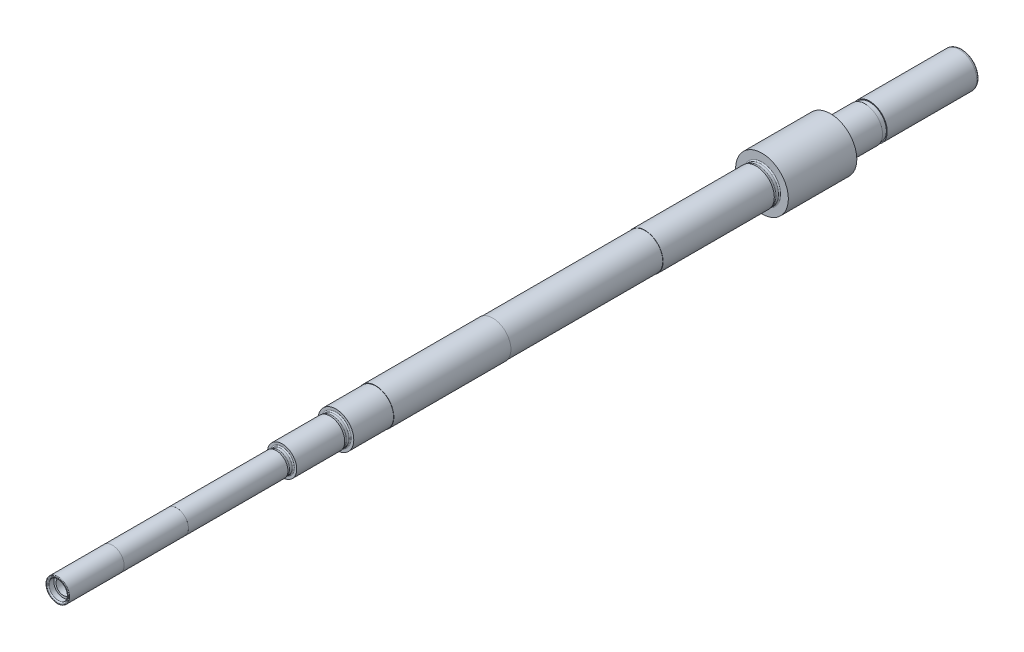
ISO-10303-21;
HEADER;
FILE_DESCRIPTION(('STEP AP214'),'2;1');
FILE_NAME('part.step','',(''),(''),'','','');
FILE_SCHEMA(('AUTOMOTIVE_DESIGN { 1 0 10303 214 1 1 1 1 }'));
ENDSEC;
DATA;
#1=APPLICATION_CONTEXT('core data for automotive mechanical design processes');
#2=APPLICATION_PROTOCOL_DEFINITION('international standard','automotive_design',2000,#1);
#3=PRODUCT_CONTEXT('',#1,'mechanical');
#4=PRODUCT('Part','Part','',(#3));
#5=PRODUCT_RELATED_PRODUCT_CATEGORY('part','',(#4));
#6=PRODUCT_DEFINITION_FORMATION('','',#4);
#7=PRODUCT_DEFINITION_CONTEXT('part definition',#1,'design');
#8=PRODUCT_DEFINITION('design','',#6,#7);
#9=PRODUCT_DEFINITION_SHAPE('','',#8);
#10=(LENGTH_UNIT() NAMED_UNIT(*) SI_UNIT(.MILLI.,.METRE.));
#11=(NAMED_UNIT(*) PLANE_ANGLE_UNIT() SI_UNIT($,.RADIAN.));
#12=(NAMED_UNIT(*) SI_UNIT($,.STERADIAN.) SOLID_ANGLE_UNIT());
#13=UNCERTAINTY_MEASURE_WITH_UNIT(LENGTH_MEASURE(1.E-05),#10,'distance_accuracy_value','');
#14=(GEOMETRIC_REPRESENTATION_CONTEXT(3) GLOBAL_UNCERTAINTY_ASSIGNED_CONTEXT((#13)) GLOBAL_UNIT_ASSIGNED_CONTEXT((#10,
#11,#12)) REPRESENTATION_CONTEXT('',''));
#15=CARTESIAN_POINT('',(0.,0.,0.));
#16=DIRECTION('',(0.,0.,1.));
#17=DIRECTION('',(1.,0.,0.));
#18=AXIS2_PLACEMENT_3D('',#15,#16,#17);
#19=CARTESIAN_POINT('',(0.,0.,146.599999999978));
#20=DIRECTION('',(0.,0.,1.));
#21=DIRECTION('',(1.,0.,0.));
#22=AXIS2_PLACEMENT_3D('',#19,#20,#21);
#23=CONICAL_SURFACE('',#22,1.22934999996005,1.22173047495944);
#24=CARTESIAN_POINT('',(5.6843418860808E-11,0.,146.152553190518));
#25=VERTEX_POINT('',#24);
#26=VERTEX_LOOP('',#25);
#27=FACE_BOUND('',#26,.T.);
#28=CARTESIAN_POINT('',(0.,0.,146.6));
#29=DIRECTION('',(0.,0.,-1.));
#30=DIRECTION('',(-1.,0.,0.));
#31=AXIS2_PLACEMENT_3D('',#28,#29,#30);
#32=CIRCLE('',#31,1.22935);
#33=CARTESIAN_POINT('',(-1.22935,0.,146.6));
#34=VERTEX_POINT('',#33);
#35=EDGE_CURVE('E72',#34,#34,#32,.F.);
#36=ORIENTED_EDGE('',*,*,#35,.T.);
#37=EDGE_LOOP('',(#36));
#38=FACE_BOUND('',#37,.T.);
#39=ADVANCED_FACE('F17',(#27,#38),#23,.F.);
#40=CARTESIAN_POINT('',(0.,0.,154.6));
#41=DIRECTION('',(0.,0.,-1.));
#42=DIRECTION('',(-1.,0.,0.));
#43=AXIS2_PLACEMENT_3D('',#40,#41,#42);
#44=CYLINDRICAL_SURFACE('',#43,1.22935);
#45=ORIENTED_EDGE('',*,*,#35,.F.);
#46=EDGE_LOOP('',(#45));
#47=FACE_BOUND('',#46,.T.);
#48=CARTESIAN_POINT('',(0.,0.,153.6));
#49=DIRECTION('',(0.,0.,-1.));
#50=DIRECTION('',(-1.,0.,0.));
#51=AXIS2_PLACEMENT_3D('',#48,#49,#50);
#52=CIRCLE('',#51,1.22935);
#53=CARTESIAN_POINT('',(-1.22935,0.,153.6));
#54=VERTEX_POINT('',#53);
#55=EDGE_CURVE('E20',#54,#54,#52,.F.);
#56=ORIENTED_EDGE('',*,*,#55,.T.);
#57=EDGE_LOOP('',(#56));
#58=FACE_BOUND('',#57,.T.);
#59=ADVANCED_FACE('F69',(#47,#58),#44,.F.);
#60=CARTESIAN_POINT('',(0.,0.,153.6));
#61=DIRECTION('',(0.,0.,-1.));
#62=DIRECTION('',(-1.,0.,0.));
#63=AXIS2_PLACEMENT_3D('',#60,#61,#62);
#64=PLANE('',#63);
#65=ORIENTED_EDGE('',*,*,#55,.F.);
#66=EDGE_LOOP('',(#65));
#67=FACE_BOUND('',#66,.T.);
#68=CARTESIAN_POINT('',(0.,0.,153.6));
#69=DIRECTION('',(0.,0.,-1.));
#70=DIRECTION('',(-1.,0.,0.));
#71=AXIS2_PLACEMENT_3D('',#68,#69,#70);
#72=CIRCLE('',#71,1.6);
#73=CARTESIAN_POINT('',(-1.6,0.,153.6));
#74=VERTEX_POINT('',#73);
#75=EDGE_CURVE('E76',#74,#74,#72,.F.);
#76=ORIENTED_EDGE('',*,*,#75,.T.);
#77=EDGE_LOOP('',(#76));
#78=FACE_BOUND('',#77,.T.);
#79=ADVANCED_FACE('F576',(#67,#78),#64,.F.);
#80=CARTESIAN_POINT('',(0.,0.,154.6));
#81=DIRECTION('',(0.,0.,-1.));
#82=DIRECTION('',(-1.,0.,0.));
#83=AXIS2_PLACEMENT_3D('',#80,#81,#82);
#84=CYLINDRICAL_SURFACE('',#83,1.6);
#85=ORIENTED_EDGE('',*,*,#75,.F.);
#86=EDGE_LOOP('',(#85));
#87=FACE_BOUND('',#86,.T.);
#88=CARTESIAN_POINT('',(0.,0.,154.4));
#89=DIRECTION('',(0.,0.,1.));
#90=DIRECTION('',(-1.,0.,0.));
#91=AXIS2_PLACEMENT_3D('',#88,#89,#90);
#92=CIRCLE('',#91,1.6);
#93=CARTESIAN_POINT('',(-1.6,0.,154.4));
#94=VERTEX_POINT('',#93);
#95=EDGE_CURVE('E566',#94,#94,#92,.F.);
#96=ORIENTED_EDGE('',*,*,#95,.F.);
#97=EDGE_LOOP('',(#96));
#98=FACE_BOUND('',#97,.T.);
#99=ADVANCED_FACE('F572',(#87,#98),#84,.F.);
#100=CARTESIAN_POINT('',(0.,0.,154.4));
#101=DIRECTION('',(0.,0.,1.));
#102=DIRECTION('',(-1.,0.,0.));
#103=AXIS2_PLACEMENT_3D('',#100,#101,#102);
#104=TOROIDAL_SURFACE('',#103,1.8,0.2);
#105=CARTESIAN_POINT('',(0.,0.,154.6));
#106=DIRECTION('',(0.,0.,1.));
#107=DIRECTION('',(1.,0.,0.));
#108=AXIS2_PLACEMENT_3D('',#105,#106,#107);
#109=CIRCLE('',#108,1.8);
#110=CARTESIAN_POINT('',(1.8,0.,154.6));
#111=VERTEX_POINT('',#110);
#112=EDGE_CURVE('E523',#111,#111,#109,.F.);
#113=ORIENTED_EDGE('',*,*,#112,.F.);
#114=EDGE_LOOP('',(#113));
#115=FACE_BOUND('',#114,.T.);
#116=ORIENTED_EDGE('',*,*,#95,.T.);
#117=EDGE_LOOP('',(#116));
#118=FACE_BOUND('',#117,.T.);
#119=ADVANCED_FACE('F568',(#115,#118),#104,.T.);
#120=CARTESIAN_POINT('',(0.,0.,2.71509783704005));
#121=DIRECTION('',(0.,0.,-1.));
#122=DIRECTION('',(-1.,0.,0.));
#123=AXIS2_PLACEMENT_3D('',#120,#121,#122);
#124=CONICAL_SURFACE('',#123,0.624999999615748,1.04719755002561);
#125=CARTESIAN_POINT('',(0.,0.,3.07594175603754));
#126=VERTEX_POINT('',#125);
#127=VERTEX_LOOP('',#126);
#128=FACE_BOUND('',#127,.T.);
#129=CARTESIAN_POINT('',(0.,0.,2.71509783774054));
#130=DIRECTION('',(0.,0.,-1.));
#131=DIRECTION('',(-1.,0.,0.));
#132=AXIS2_PLACEMENT_3D('',#129,#130,#131);
#133=CIRCLE('',#132,0.625);
#134=CARTESIAN_POINT('',(-0.625000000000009,0.,2.71509783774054));
#135=VERTEX_POINT('',#134);
#136=EDGE_CURVE('E519',#135,#135,#133,.T.);
#137=ORIENTED_EDGE('',*,*,#136,.T.);
#138=EDGE_LOOP('',(#137));
#139=FACE_BOUND('',#138,.T.);
#140=ADVANCED_FACE('F544',(#128,#139),#124,.F.);
#141=CARTESIAN_POINT('',(0.,0.,154.6));
#142=DIRECTION('',(0.,0.,1.));
#143=DIRECTION('',(1.,0.,0.));
#144=AXIS2_PLACEMENT_3D('',#141,#142,#143);
#145=PLANE('',#144);
#146=CARTESIAN_POINT('',(0.,0.,154.6));
#147=DIRECTION('',(0.,0.,-1.));
#148=DIRECTION('',(1.,0.,0.));
#149=AXIS2_PLACEMENT_3D('',#146,#147,#148);
#150=CIRCLE('',#149,1.9);
#151=CARTESIAN_POINT('',(1.9,0.,154.6));
#152=VERTEX_POINT('',#151);
#153=EDGE_CURVE('E522',#152,#152,#150,.T.);
#154=ORIENTED_EDGE('',*,*,#153,.F.);
#155=EDGE_LOOP('',(#154));
#156=FACE_BOUND('',#155,.T.);
#157=ORIENTED_EDGE('',*,*,#112,.T.);
#158=EDGE_LOOP('',(#157));
#159=FACE_BOUND('',#158,.T.);
#160=ADVANCED_FACE('F535',(#156,#159),#145,.T.);
#161=CARTESIAN_POINT('',(0.,0.,-0.274058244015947));
#162=DIRECTION('',(0.,0.,-1.));
#163=DIRECTION('',(-1.,0.,0.));
#164=AXIS2_PLACEMENT_3D('',#161,#162,#163);
#165=CYLINDRICAL_SURFACE('',#164,0.625);
#166=ORIENTED_EDGE('',*,*,#136,.F.);
#167=EDGE_LOOP('',(#166));
#168=FACE_BOUND('',#167,.T.);
#169=CARTESIAN_POINT('',(0.,0.,2.23967007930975));
#170=DIRECTION('',(0.,0.,-1.));
#171=DIRECTION('',(1.,0.,0.));
#172=AXIS2_PLACEMENT_3D('',#169,#170,#171);
#173=CIRCLE('',#172,0.625);
#174=CARTESIAN_POINT('',(0.62499999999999,0.,2.23967007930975));
#175=VERTEX_POINT('',#174);
#176=EDGE_CURVE('E493',#175,#175,#173,.F.);
#177=ORIENTED_EDGE('',*,*,#176,.F.);
#178=EDGE_LOOP('',(#177));
#179=FACE_BOUND('',#178,.T.);
#180=ADVANCED_FACE('F512',(#168,#179),#165,.F.);
#181=CARTESIAN_POINT('',(0.,0.,154.5));
#182=DIRECTION('',(0.,0.,1.));
#183=DIRECTION('',(-1.,0.,0.));
#184=AXIS2_PLACEMENT_3D('',#181,#182,#183);
#185=TOROIDAL_SURFACE('',#184,1.9,0.1);
#186=ORIENTED_EDGE('',*,*,#153,.T.);
#187=EDGE_LOOP('',(#186));
#188=FACE_BOUND('',#187,.T.);
#189=CARTESIAN_POINT('',(0.,0.,154.5));
#190=DIRECTION('',(0.,0.,1.));
#191=DIRECTION('',(1.,0.,0.));
#192=AXIS2_PLACEMENT_3D('',#189,#190,#191);
#193=CIRCLE('',#192,2.);
#194=CARTESIAN_POINT('',(2.,0.,154.5));
#195=VERTEX_POINT('',#194);
#196=EDGE_CURVE('E484',#195,#195,#193,.F.);
#197=ORIENTED_EDGE('',*,*,#196,.F.);
#198=EDGE_LOOP('',(#197));
#199=FACE_BOUND('',#198,.T.);
#200=ADVANCED_FACE('F505',(#188,#199),#185,.T.);
#201=CARTESIAN_POINT('',(0.,0.,2.23967007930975));
#202=DIRECTION('',(0.,0.,-1.));
#203=DIRECTION('',(1.,0.,0.));
#204=AXIS2_PLACEMENT_3D('',#201,#202,#203);
#205=TOROIDAL_SURFACE('',#204,4.42570004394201,3.80070004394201);
#206=ORIENTED_EDGE('',*,*,#176,.T.);
#207=EDGE_LOOP('',(#206));
#208=FACE_BOUND('',#207,.T.);
#209=CARTESIAN_POINT('',(0.,0.,0.));
#210=DIRECTION('',(0.,0.,-1.));
#211=DIRECTION('',(-1.,0.,0.));
#212=AXIS2_PLACEMENT_3D('',#209,#210,#211);
#213=CIRCLE('',#212,1.355);
#214=CARTESIAN_POINT('',(-1.35500000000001,0.,0.));
#215=VERTEX_POINT('',#214);
#216=EDGE_CURVE('E492',#215,#215,#213,.F.);
#217=ORIENTED_EDGE('',*,*,#216,.F.);
#218=EDGE_LOOP('',(#217));
#219=FACE_BOUND('',#218,.T.);
#220=ADVANCED_FACE('F500',(#208,#219),#205,.T.);
#221=CARTESIAN_POINT('',(0.,0.,116.2));
#222=DIRECTION('',(0.,0.,1.));
#223=DIRECTION('',(1.,0.,0.));
#224=AXIS2_PLACEMENT_3D('',#221,#222,#223);
#225=CYLINDRICAL_SURFACE('',#224,2.);
#226=CARTESIAN_POINT('',(0.,0.,145.2));
#227=DIRECTION('',(0.,0.,1.));
#228=DIRECTION('',(1.,0.,0.));
#229=AXIS2_PLACEMENT_3D('',#226,#227,#228);
#230=CIRCLE('',#229,2.);
#231=CARTESIAN_POINT('',(2.,0.,145.2));
#232=VERTEX_POINT('',#231);
#233=EDGE_CURVE('E592',#232,#232,#230,.T.);
#234=ORIENTED_EDGE('',*,*,#233,.T.);
#235=EDGE_LOOP('',(#234));
#236=FACE_BOUND('',#235,.T.);
#237=ORIENTED_EDGE('',*,*,#196,.T.);
#238=EDGE_LOOP('',(#237));
#239=FACE_BOUND('',#238,.T.);
#240=ADVANCED_FACE('F504',(#236,#239),#225,.T.);
#241=CARTESIAN_POINT('',(0.,0.,0.));
#242=DIRECTION('',(0.,0.,-1.));
#243=DIRECTION('',(-1.,0.,0.));
#244=AXIS2_PLACEMENT_3D('',#241,#242,#243);
#245=PLANE('',#244);
#246=ORIENTED_EDGE('',*,*,#216,.T.);
#247=EDGE_LOOP('',(#246));
#248=FACE_BOUND('',#247,.T.);
#249=CARTESIAN_POINT('',(0.,0.,0.));
#250=DIRECTION('',(0.,0.,1.));
#251=DIRECTION('',(-1.,0.,0.));
#252=AXIS2_PLACEMENT_3D('',#249,#250,#251);
#253=CIRCLE('',#252,2.5);
#254=CARTESIAN_POINT('',(-2.5,0.,0.));
#255=VERTEX_POINT('',#254);
#256=EDGE_CURVE('E595',#255,#255,#253,.T.);
#257=ORIENTED_EDGE('',*,*,#256,.F.);
#258=EDGE_LOOP('',(#257));
#259=FACE_BOUND('',#258,.T.);
#260=ADVANCED_FACE('F645',(#248,#259),#245,.T.);
#261=CARTESIAN_POINT('',(0.,-1.8,11.));
#262=DIRECTION('',(0.,1.,0.));
#263=DIRECTION('',(0.,0.,1.));
#264=AXIS2_PLACEMENT_3D('',#261,#262,#263);
#265=PLANE('',#264);
#266=CARTESIAN_POINT('',(0.,-1.8,3.));
#267=DIRECTION('',(0.,1.,0.));
#268=DIRECTION('',(0.,0.,1.));
#269=AXIS2_PLACEMENT_3D('',#266,#267,#268);
#270=CIRCLE('',#269,1.00000000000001);
#271=CARTESIAN_POINT('',(-1.00000000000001,-1.8,3.));
#272=VERTEX_POINT('',#271);
#273=CARTESIAN_POINT('',(1.00000000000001,-1.8,3.));
#274=VERTEX_POINT('',#273);
#275=EDGE_CURVE('E457',#272,#274,#270,.F.);
#276=ORIENTED_EDGE('',*,*,#275,.T.);
#277=DIRECTION('',(0.,0.,-1.));
#278=VECTOR('',#277,1.);
#279=CARTESIAN_POINT('',(0.999999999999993,-1.8,11.));
#280=LINE('',#279,#278);
#281=CARTESIAN_POINT('',(0.999999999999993,-1.8,11.));
#282=VERTEX_POINT('',#281);
#283=EDGE_CURVE('E58',#274,#282,#280,.F.);
#284=ORIENTED_EDGE('',*,*,#283,.T.);
#285=CARTESIAN_POINT('',(0.,-1.8,11.));
#286=DIRECTION('',(0.,1.,0.));
#287=DIRECTION('',(0.,0.,1.));
#288=AXIS2_PLACEMENT_3D('',#285,#286,#287);
#289=CIRCLE('',#288,0.999999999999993);
#290=CARTESIAN_POINT('',(-1.,-1.8,11.));
#291=VERTEX_POINT('',#290);
#292=EDGE_CURVE('E61',#282,#291,#289,.F.);
#293=ORIENTED_EDGE('',*,*,#292,.T.);
#294=DIRECTION('',(0.,0.,1.));
#295=VECTOR('',#294,1.);
#296=CARTESIAN_POINT('',(-1.00000000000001,-1.8,3.));
#297=LINE('',#296,#295);
#298=EDGE_CURVE('E597',#291,#272,#297,.F.);
#299=ORIENTED_EDGE('',*,*,#298,.T.);
#300=EDGE_LOOP('',(#276,#284,#293,#299));
#301=FACE_BOUND('',#300,.T.);
#302=ADVANCED_FACE('F599',(#301),#265,.F.);
#303=CARTESIAN_POINT('',(0.,0.,145.2));
#304=DIRECTION('',(0.,0.,1.));
#305=DIRECTION('',(1.,0.,0.));
#306=AXIS2_PLACEMENT_3D('',#303,#304,#305);
#307=PLANE('',#306);
#308=CARTESIAN_POINT('',(0.,0.,145.2));
#309=DIRECTION('',(0.,0.,1.));
#310=DIRECTION('',(1.,0.,0.));
#311=AXIS2_PLACEMENT_3D('',#308,#309,#310);
#312=CIRCLE('',#311,1.995);
#313=CARTESIAN_POINT('',(1.995,0.,145.2));
#314=VERTEX_POINT('',#313);
#315=EDGE_CURVE('E445',#314,#314,#312,.F.);
#316=ORIENTED_EDGE('',*,*,#315,.F.);
#317=EDGE_LOOP('',(#316));
#318=FACE_BOUND('',#317,.T.);
#319=ORIENTED_EDGE('',*,*,#233,.F.);
#320=EDGE_LOOP('',(#319));
#321=FACE_BOUND('',#320,.T.);
#322=ADVANCED_FACE('F475',(#318,#321),#307,.F.);
#323=CARTESIAN_POINT('',(0.,0.,0.5));
#324=DIRECTION('',(0.,0.,-1.));
#325=DIRECTION('',(1.,0.,0.));
#326=AXIS2_PLACEMENT_3D('',#323,#324,#325);
#327=TOROIDAL_SURFACE('',#326,2.5,0.5);
#328=CARTESIAN_POINT('',(0.,0.,0.499999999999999));
#329=DIRECTION('',(0.,0.,1.));
#330=DIRECTION('',(1.,0.,0.));
#331=AXIS2_PLACEMENT_3D('',#328,#329,#330);
#332=CIRCLE('',#331,3.);
#333=CARTESIAN_POINT('',(3.,0.,0.499999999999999));
#334=VERTEX_POINT('',#333);
#335=EDGE_CURVE('E441',#334,#334,#332,.T.);
#336=ORIENTED_EDGE('',*,*,#335,.F.);
#337=EDGE_LOOP('',(#336));
#338=FACE_BOUND('',#337,.T.);
#339=ORIENTED_EDGE('',*,*,#256,.T.);
#340=EDGE_LOOP('',(#339));
#341=FACE_BOUND('',#340,.T.);
#342=ADVANCED_FACE('F469',(#338,#341),#327,.T.);
#343=CARTESIAN_POINT('',(-1.00000000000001,-5.,3.));
#344=DIRECTION('',(-1.,0.,0.));
#345=DIRECTION('',(0.,0.,1.));
#346=AXIS2_PLACEMENT_3D('',#343,#344,#345);
#347=PLANE('',#346);
#348=DIRECTION('',(0.,1.,0.));
#349=VECTOR('',#348,1.);
#350=CARTESIAN_POINT('',(-1.,-5.,3.));
#351=LINE('',#350,#349);
#352=CARTESIAN_POINT('',(-1.00000000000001,-2.82842712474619,3.));
#353=VERTEX_POINT('',#352);
#354=EDGE_CURVE('E458',#353,#272,#351,.T.);
#355=ORIENTED_EDGE('',*,*,#354,.T.);
#356=ORIENTED_EDGE('',*,*,#298,.F.);
#357=DIRECTION('',(0.,1.,0.));
#358=VECTOR('',#357,1.);
#359=CARTESIAN_POINT('',(-0.999999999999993,-5.,11.));
#360=LINE('',#359,#358);
#361=CARTESIAN_POINT('',(-0.999999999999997,-2.82842712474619,11.));
#362=VERTEX_POINT('',#361);
#363=EDGE_CURVE('E463',#291,#362,#360,.F.);
#364=ORIENTED_EDGE('',*,*,#363,.T.);
#365=DIRECTION('',(0.,0.,1.));
#366=VECTOR('',#365,1.);
#367=CARTESIAN_POINT('',(-1.00000000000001,-2.82842712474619,0.));
#368=LINE('',#367,#366);
#369=EDGE_CURVE('E444',#353,#362,#368,.T.);
#370=ORIENTED_EDGE('',*,*,#369,.F.);
#371=EDGE_LOOP('',(#355,#356,#364,#370));
#372=FACE_BOUND('',#371,.T.);
#373=ADVANCED_FACE('F474',(#372),#347,.F.);
#374=CARTESIAN_POINT('',(0.,-5.,11.));
#375=DIRECTION('',(0.,1.,0.));
#376=DIRECTION('',(0.,0.,1.));
#377=AXIS2_PLACEMENT_3D('',#374,#375,#376);
#378=CYLINDRICAL_SURFACE('',#377,0.999999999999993);
#379=ORIENTED_EDGE('',*,*,#363,.F.);
#380=ORIENTED_EDGE('',*,*,#292,.F.);
#381=DIRECTION('',(0.,1.,0.));
#382=VECTOR('',#381,1.);
#383=CARTESIAN_POINT('',(0.999999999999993,-5.,11.));
#384=LINE('',#383,#382);
#385=CARTESIAN_POINT('',(0.999999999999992,-2.82842712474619,11.));
#386=VERTEX_POINT('',#385);
#387=EDGE_CURVE('E461',#282,#386,#384,.F.);
#388=ORIENTED_EDGE('',*,*,#387,.T.);
#389=CARTESIAN_POINT('',(-0.999999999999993,-2.82842712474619,11.));
#390=CARTESIAN_POINT('',(-1.00000074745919,-2.82842442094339,11.0272904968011));
#391=CARTESIAN_POINT('',(-0.998882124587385,-2.82882259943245,11.0545670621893));
#392=CARTESIAN_POINT('',(-0.994425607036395,-2.83039327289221,11.1089085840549));
#393=CARTESIAN_POINT('',(-0.991088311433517,-2.83156555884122,11.1359735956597));
#394=CARTESIAN_POINT('',(-0.977810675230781,-2.83619092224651,11.2163921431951));
#395=CARTESIAN_POINT('',(-0.964604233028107,-2.84075292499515,11.2691808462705));
#396=CARTESIAN_POINT('',(-0.929958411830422,-2.85228074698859,11.3716251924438));
#397=CARTESIAN_POINT('',(-0.908523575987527,-2.85924523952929,11.4212825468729));
#398=CARTESIAN_POINT('',(-0.858073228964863,-2.87478787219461,11.5163398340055));
#399=CARTESIAN_POINT('',(-0.82905306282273,-2.88336700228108,11.5617371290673));
#400=CARTESIAN_POINT('',(-0.763051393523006,-2.90154480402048,11.6487202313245));
#401=CARTESIAN_POINT('',(-0.72582498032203,-2.91116877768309,11.6901148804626));
#402=CARTESIAN_POINT('',(-0.644988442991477,-2.93013848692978,11.7662060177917));
#403=CARTESIAN_POINT('',(-0.601377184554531,-2.93948417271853,11.8009013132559));
#404=CARTESIAN_POINT('',(-0.50760364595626,-2.95713882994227,11.8634795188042));
#405=CARTESIAN_POINT('',(-0.457300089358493,-2.96541437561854,11.8911609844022));
#406=CARTESIAN_POINT('',(-0.352429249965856,-2.97969608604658,11.9375922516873));
#407=CARTESIAN_POINT('',(-0.297863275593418,-2.9857029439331,11.9563447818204));
#408=CARTESIAN_POINT('',(-0.188029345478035,-2.99459071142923,11.9837357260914));
#409=CARTESIAN_POINT('',(-0.13285183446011,-2.99757308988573,11.9927032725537));
#410=CARTESIAN_POINT('',(-0.0216989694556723,-3.00043608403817,12.0013162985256));
#411=CARTESIAN_POINT('',(0.0342761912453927,-3.00031743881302,12.0009639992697));
#412=CARTESIAN_POINT('',(0.143103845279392,-2.99706038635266,11.9911557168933));
#413=CARTESIAN_POINT('',(0.195992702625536,-2.99404060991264,11.9820573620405));
#414=CARTESIAN_POINT('',(0.299444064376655,-2.98546960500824,11.9556068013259));
#415=CARTESIAN_POINT('',(0.350006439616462,-2.97991823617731,11.9382541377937));
#416=CARTESIAN_POINT('',(0.44815262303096,-2.96675668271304,11.8955786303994));
#417=CARTESIAN_POINT('',(0.495688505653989,-2.95912037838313,11.8701539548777));
#418=CARTESIAN_POINT('',(0.585924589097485,-2.94258387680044,11.8121400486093));
#419=CARTESIAN_POINT('',(0.628623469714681,-2.93368333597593,11.7795488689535));
#420=CARTESIAN_POINT('',(0.710097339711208,-2.9150627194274,11.7063289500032));
#421=CARTESIAN_POINT('',(0.748593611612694,-2.90532378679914,11.6653944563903));
#422=CARTESIAN_POINT('',(0.818272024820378,-2.88647490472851,11.5775585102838));
#423=CARTESIAN_POINT('',(0.849451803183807,-2.87736515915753,11.5306551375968));
#424=CARTESIAN_POINT('',(0.904003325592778,-2.86070031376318,11.4313198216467));
#425=CARTESIAN_POINT('',(0.927253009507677,-2.85317014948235,11.3788164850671));
#426=CARTESIAN_POINT('',(0.96446023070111,-2.84081097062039,11.27035302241));
#427=CARTESIAN_POINT('',(0.97843243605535,-2.83597769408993,11.2143985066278));
#428=CARTESIAN_POINT('',(0.991658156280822,-2.8313654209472,11.131581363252));
#429=CARTESIAN_POINT('',(0.994785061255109,-2.83026667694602,11.1053586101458));
#430=CARTESIAN_POINT('',(0.99895461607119,-2.82879703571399,11.0527619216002));
#431=CARTESIAN_POINT('',(0.999999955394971,-2.82842519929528,11.0263882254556));
#432=CARTESIAN_POINT('',(0.999999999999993,-2.82842712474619,11.));
#433=B_SPLINE_CURVE_WITH_KNOTS('',3,(#389,#390,#391,#392,#393,#394,#395,#396,#397,#398,#399,
#400,#401,#402,#403,#404,#405,#406,#407,#408,#409,#410,#411,#412,#413,#414,#415,#416,#417,#418,
#419,#420,#421,#422,#423,#424,#425,#426,#427,#428,#429,#430,#431,#432),.UNSPECIFIED.,.F.,.F.,(4,
2,2,2,2,2,2,2,2,2,2,2,2,2,2,2,2,2,2,2,2,4),(0.,0.0818184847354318,0.163614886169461,
0.326581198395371,0.489457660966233,0.652434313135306,0.821165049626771,0.989925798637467,
1.163091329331,1.33620391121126,1.50329470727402,1.67034568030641,1.83084418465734,
1.99135158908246,2.15397018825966,2.31663306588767,2.48694054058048,2.6573029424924,
2.83018029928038,3.00278367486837,3.08199895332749,3.16111181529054),.UNSPECIFIED.);
#434=EDGE_CURVE('E151',#362,#386,#433,.T.);
#435=ORIENTED_EDGE('',*,*,#434,.F.);
#436=EDGE_LOOP('',(#379,#380,#388,#435));
#437=FACE_BOUND('',#436,.T.);
#438=ADVANCED_FACE('F606',(#437),#378,.F.);
#439=CARTESIAN_POINT('',(0.999999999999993,-5.,11.));
#440=DIRECTION('',(1.,0.,0.));
#441=DIRECTION('',(0.,0.,-1.));
#442=AXIS2_PLACEMENT_3D('',#439,#440,#441);
#443=PLANE('',#442);
#444=ORIENTED_EDGE('',*,*,#387,.F.);
#445=ORIENTED_EDGE('',*,*,#283,.F.);
#446=DIRECTION('',(0.,1.,0.));
#447=VECTOR('',#446,1.);
#448=CARTESIAN_POINT('',(1.00000000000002,-5.,3.));
#449=LINE('',#448,#447);
#450=CARTESIAN_POINT('',(1.00000000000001,-2.82842712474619,3.));
#451=VERTEX_POINT('',#450);
#452=EDGE_CURVE('E35',#274,#451,#449,.F.);
#453=ORIENTED_EDGE('',*,*,#452,.T.);
#454=DIRECTION('',(0.,0.,1.));
#455=VECTOR('',#454,1.);
#456=CARTESIAN_POINT('',(0.999999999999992,-2.82842712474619,0.));
#457=LINE('',#456,#455);
#458=EDGE_CURVE('E150',#386,#451,#457,.F.);
#459=ORIENTED_EDGE('',*,*,#458,.F.);
#460=EDGE_LOOP('',(#444,#445,#453,#459));
#461=FACE_BOUND('',#460,.T.);
#462=ADVANCED_FACE('F176',(#461),#443,.F.);
#463=CARTESIAN_POINT('',(0.,-5.,3.));
#464=DIRECTION('',(0.,1.,0.));
#465=DIRECTION('',(0.,0.,1.));
#466=AXIS2_PLACEMENT_3D('',#463,#464,#465);
#467=CYLINDRICAL_SURFACE('',#466,1.00000000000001);
#468=ORIENTED_EDGE('',*,*,#452,.F.);
#469=ORIENTED_EDGE('',*,*,#275,.F.);
#470=ORIENTED_EDGE('',*,*,#354,.F.);
#471=CARTESIAN_POINT('',(1.00000000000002,-2.82842712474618,3.));
#472=CARTESIAN_POINT('',(1.00000074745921,-2.82842442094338,2.97270950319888));
#473=CARTESIAN_POINT('',(0.998882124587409,-2.82882259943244,2.94543293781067));
#474=CARTESIAN_POINT('',(0.994425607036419,-2.8303932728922,2.8910914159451));
#475=CARTESIAN_POINT('',(0.991088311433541,-2.83156555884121,2.8640264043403));
#476=CARTESIAN_POINT('',(0.977810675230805,-2.8361909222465,2.78360785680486));
#477=CARTESIAN_POINT('',(0.96460423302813,-2.84075292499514,2.73081915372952));
#478=CARTESIAN_POINT('',(0.929958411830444,-2.85228074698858,2.62837480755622));
#479=CARTESIAN_POINT('',(0.90852357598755,-2.85924523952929,2.57871745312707));
#480=CARTESIAN_POINT('',(0.858073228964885,-2.8747878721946,2.48366016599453));
#481=CARTESIAN_POINT('',(0.829053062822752,-2.88336700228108,2.43826287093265));
#482=CARTESIAN_POINT('',(0.763051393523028,-2.90154480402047,2.35127976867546));
#483=CARTESIAN_POINT('',(0.725824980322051,-2.91116877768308,2.30988511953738));
#484=CARTESIAN_POINT('',(0.644988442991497,-2.93013848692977,2.2337939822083));
#485=CARTESIAN_POINT('',(0.601377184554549,-2.93948417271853,2.19909868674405));
#486=CARTESIAN_POINT('',(0.507603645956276,-2.95713882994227,2.13652048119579));
#487=CARTESIAN_POINT('',(0.457300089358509,-2.96541437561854,2.10883901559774));
#488=CARTESIAN_POINT('',(0.35242924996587,-2.97969608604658,2.06240774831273));
#489=CARTESIAN_POINT('',(0.297863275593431,-2.98570294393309,2.04365521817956));
#490=CARTESIAN_POINT('',(0.188029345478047,-2.99459071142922,2.01626427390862));
#491=CARTESIAN_POINT('',(0.132851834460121,-2.99757308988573,2.00729672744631));
#492=CARTESIAN_POINT('',(0.0216989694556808,-3.00043608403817,1.99868370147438));
#493=CARTESIAN_POINT('',(-0.0342761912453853,-3.00031743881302,1.99903600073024));
#494=CARTESIAN_POINT('',(-0.143103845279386,-2.99706038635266,2.00884428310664));
#495=CARTESIAN_POINT('',(-0.195992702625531,-2.99404060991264,2.01794263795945));
#496=CARTESIAN_POINT('',(-0.299444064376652,-2.98546960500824,2.04439319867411));
#497=CARTESIAN_POINT('',(-0.35000643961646,-2.97991823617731,2.06174586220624));
#498=CARTESIAN_POINT('',(-0.448152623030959,-2.96675668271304,2.10442136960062));
#499=CARTESIAN_POINT('',(-0.495688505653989,-2.95912037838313,2.12984604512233));
#500=CARTESIAN_POINT('',(-0.585924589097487,-2.94258387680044,2.18785995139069));
#501=CARTESIAN_POINT('',(-0.628623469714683,-2.93368333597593,2.22045113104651));
#502=CARTESIAN_POINT('',(-0.710097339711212,-2.91506271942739,2.29367104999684));
#503=CARTESIAN_POINT('',(-0.748593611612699,-2.90532378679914,2.3346055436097));
#504=CARTESIAN_POINT('',(-0.818272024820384,-2.88647490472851,2.42244148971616));
#505=CARTESIAN_POINT('',(-0.849451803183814,-2.87736515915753,2.46934486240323));
#506=CARTESIAN_POINT('',(-0.904003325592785,-2.86070031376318,2.56868017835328));
#507=CARTESIAN_POINT('',(-0.927253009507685,-2.85317014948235,2.62118351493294));
#508=CARTESIAN_POINT('',(-0.964460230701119,-2.84081097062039,2.72964697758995));
#509=CARTESIAN_POINT('',(-0.978432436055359,-2.83597769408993,2.78560149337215));
#510=CARTESIAN_POINT('',(-0.991658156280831,-2.8313654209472,2.86841863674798));
#511=CARTESIAN_POINT('',(-0.994785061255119,-2.83026667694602,2.89464138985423));
#512=CARTESIAN_POINT('',(-0.9989546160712,-2.82879703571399,2.94723807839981));
#513=CARTESIAN_POINT('',(-0.999999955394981,-2.82842519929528,2.9736117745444));
#514=CARTESIAN_POINT('',(-1.,-2.82842712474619,3.));
#515=B_SPLINE_CURVE_WITH_KNOTS('',3,(#471,#472,#473,#474,#475,#476,#477,#478,#479,#480,#481,
#482,#483,#484,#485,#486,#487,#488,#489,#490,#491,#492,#493,#494,#495,#496,#497,#498,#499,#500,
#501,#502,#503,#504,#505,#506,#507,#508,#509,#510,#511,#512,#513,#514),.UNSPECIFIED.,.F.,.F.,(4,
2,2,2,2,2,2,2,2,2,2,2,2,2,2,2,2,2,2,2,2,4),(0.,0.0818184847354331,0.163614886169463,
0.326581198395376,0.489457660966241,0.652434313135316,0.821165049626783,0.989925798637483,
1.16309132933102,1.33620391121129,1.50329470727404,1.67034568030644,1.83084418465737,
1.9913515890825,2.1539701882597,2.31663306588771,2.48694054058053,2.65730294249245,
2.83018029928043,3.00278367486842,3.08199895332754,3.1611118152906),.UNSPECIFIED.);
#516=EDGE_CURVE('E142',#451,#353,#515,.T.);
#517=ORIENTED_EDGE('',*,*,#516,.F.);
#518=EDGE_LOOP('',(#468,#469,#470,#517));
#519=FACE_BOUND('',#518,.T.);
#520=ADVANCED_FACE('F157',(#519),#467,.F.);
#521=CARTESIAN_POINT('',(0.,0.,139.7));
#522=DIRECTION('',(0.,0.,1.));
#523=DIRECTION('',(1.,0.,0.));
#524=AXIS2_PLACEMENT_3D('',#521,#522,#523);
#525=CYLINDRICAL_SURFACE('',#524,1.995);
#526=CARTESIAN_POINT('',(0.,0.,134.2));
#527=DIRECTION('',(0.,0.,1.));
#528=DIRECTION('',(1.,0.,0.));
#529=AXIS2_PLACEMENT_3D('',#526,#527,#528);
#530=CIRCLE('',#529,1.995);
#531=CARTESIAN_POINT('',(1.995,0.,134.2));
#532=VERTEX_POINT('',#531);
#533=EDGE_CURVE('E139',#532,#532,#530,.F.);
#534=ORIENTED_EDGE('',*,*,#533,.F.);
#535=EDGE_LOOP('',(#534));
#536=FACE_BOUND('',#535,.T.);
#537=ORIENTED_EDGE('',*,*,#315,.T.);
#538=EDGE_LOOP('',(#537));
#539=FACE_BOUND('',#538,.T.);
#540=ADVANCED_FACE('F166',(#536,#539),#525,.T.);
#541=CARTESIAN_POINT('',(0.,0.,0.));
#542=DIRECTION('',(0.,0.,1.));
#543=DIRECTION('',(1.,0.,0.));
#544=AXIS2_PLACEMENT_3D('',#541,#542,#543);
#545=CYLINDRICAL_SURFACE('',#544,3.);
#546=CARTESIAN_POINT('',(0.,0.,15.8));
#547=DIRECTION('',(0.,0.,1.));
#548=DIRECTION('',(1.,0.,0.));
#549=AXIS2_PLACEMENT_3D('',#546,#547,#548);
#550=CIRCLE('',#549,3.);
#551=CARTESIAN_POINT('',(3.,0.,15.8));
#552=VERTEX_POINT('',#551);
#553=EDGE_CURVE('E136',#552,#552,#550,.T.);
#554=ORIENTED_EDGE('',*,*,#553,.F.);
#555=EDGE_LOOP('',(#554));
#556=FACE_BOUND('',#555,.T.);
#557=ORIENTED_EDGE('',*,*,#458,.T.);
#558=ORIENTED_EDGE('',*,*,#516,.T.);
#559=ORIENTED_EDGE('',*,*,#369,.T.);
#560=ORIENTED_EDGE('',*,*,#434,.T.);
#561=EDGE_LOOP('',(#557,#558,#559,#560));
#562=FACE_BOUND('',#561,.T.);
#563=ORIENTED_EDGE('',*,*,#335,.T.);
#564=EDGE_LOOP('',(#563));
#565=FACE_BOUND('',#564,.T.);
#566=ADVANCED_FACE('F161',(#556,#562,#565),#545,.T.);
#567=CARTESIAN_POINT('',(0.,0.,134.2));
#568=DIRECTION('',(0.,0.,1.));
#569=DIRECTION('',(1.,0.,0.));
#570=AXIS2_PLACEMENT_3D('',#567,#568,#569);
#571=PLANE('',#570);
#572=ORIENTED_EDGE('',*,*,#533,.T.);
#573=EDGE_LOOP('',(#572));
#574=FACE_BOUND('',#573,.T.);
#575=CARTESIAN_POINT('',(0.,0.,134.2));
#576=DIRECTION('',(0.,0.,1.));
#577=DIRECTION('',(1.,0.,0.));
#578=AXIS2_PLACEMENT_3D('',#575,#576,#577);
#579=CIRCLE('',#578,2.);
#580=CARTESIAN_POINT('',(2.,0.,134.2));
#581=VERTEX_POINT('',#580);
#582=EDGE_CURVE('E133',#581,#581,#579,.F.);
#583=ORIENTED_EDGE('',*,*,#582,.F.);
#584=EDGE_LOOP('',(#583));
#585=FACE_BOUND('',#584,.T.);
#586=ADVANCED_FACE('F165',(#574,#585),#571,.T.);
#587=CARTESIAN_POINT('',(0.,0.,15.8));
#588=DIRECTION('',(0.,0.,1.));
#589=DIRECTION('',(1.,0.,0.));
#590=AXIS2_PLACEMENT_3D('',#587,#588,#589);
#591=PLANE('',#590);
#592=CARTESIAN_POINT('',(0.,0.,15.8));
#593=DIRECTION('',(0.,0.,1.));
#594=DIRECTION('',(1.,0.,0.));
#595=AXIS2_PLACEMENT_3D('',#592,#593,#594);
#596=CIRCLE('',#595,2.85);
#597=CARTESIAN_POINT('',(2.85,0.,15.8));
#598=VERTEX_POINT('',#597);
#599=EDGE_CURVE('E130',#598,#598,#596,.T.);
#600=ORIENTED_EDGE('',*,*,#599,.F.);
#601=EDGE_LOOP('',(#600));
#602=FACE_BOUND('',#601,.T.);
#603=ORIENTED_EDGE('',*,*,#553,.T.);
#604=EDGE_LOOP('',(#603));
#605=FACE_BOUND('',#604,.T.);
#606=ADVANCED_FACE('F424',(#602,#605),#591,.T.);
#607=CARTESIAN_POINT('',(0.,0.,116.2));
#608=DIRECTION('',(0.,0.,1.));
#609=DIRECTION('',(1.,0.,0.));
#610=AXIS2_PLACEMENT_3D('',#607,#608,#609);
#611=CYLINDRICAL_SURFACE('',#610,2.);
#612=ORIENTED_EDGE('',*,*,#582,.T.);
#613=EDGE_LOOP('',(#612));
#614=FACE_BOUND('',#613,.T.);
#615=CARTESIAN_POINT('',(0.,0.,117.199999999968));
#616=DIRECTION('',(0.,0.,1.));
#617=DIRECTION('',(0.,1.,0.));
#618=AXIS2_PLACEMENT_3D('',#615,#616,#617);
#619=CIRCLE('',#618,2.00000000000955);
#620=CARTESIAN_POINT('',(0.,2.00000000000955,117.199999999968));
#621=VERTEX_POINT('',#620);
#622=EDGE_CURVE('E129',#621,#621,#619,.F.);
#623=ORIENTED_EDGE('',*,*,#622,.F.);
#624=EDGE_LOOP('',(#623));
#625=FACE_BOUND('',#624,.T.);
#626=ADVANCED_FACE('F421',(#614,#625),#611,.T.);
#627=CARTESIAN_POINT('',(0.,0.,16.2));
#628=DIRECTION('',(0.,0.,1.));
#629=DIRECTION('',(1.,0.,0.));
#630=AXIS2_PLACEMENT_3D('',#627,#628,#629);
#631=CYLINDRICAL_SURFACE('',#630,2.85);
#632=ORIENTED_EDGE('',*,*,#599,.T.);
#633=EDGE_LOOP('',(#632));
#634=FACE_BOUND('',#633,.T.);
#635=CARTESIAN_POINT('',(0.,0.,16.6));
#636=DIRECTION('',(0.,0.,1.));
#637=DIRECTION('',(1.,0.,0.));
#638=AXIS2_PLACEMENT_3D('',#635,#636,#637);
#639=CIRCLE('',#638,2.85);
#640=CARTESIAN_POINT('',(2.85,0.,16.6));
#641=VERTEX_POINT('',#640);
#642=EDGE_CURVE('E126',#641,#641,#639,.F.);
#643=ORIENTED_EDGE('',*,*,#642,.T.);
#644=EDGE_LOOP('',(#643));
#645=FACE_BOUND('',#644,.T.);
#646=ADVANCED_FACE('F417',(#634,#645),#631,.T.);
#647=CARTESIAN_POINT('',(0.,0.,117.199999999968));
#648=DIRECTION('',(0.,0.,1.));
#649=DIRECTION('',(1.,0.,0.));
#650=AXIS2_PLACEMENT_3D('',#647,#648,#649);
#651=CONICAL_SURFACE('',#650,2.00000000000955,0.261799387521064);
#652=ORIENTED_EDGE('',*,*,#622,.T.);
#653=EDGE_LOOP('',(#652));
#654=FACE_BOUND('',#653,.T.);
#655=CARTESIAN_POINT('',(0.,0.,116.852228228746));
#656=DIRECTION('',(0.,0.,-1.));
#657=DIRECTION('',(0.,-1.,0.));
#658=AXIS2_PLACEMENT_3D('',#655,#656,#657);
#659=CIRCLE('',#658,1.90681483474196);
#660=CARTESIAN_POINT('',(0.,-1.90681483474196,116.852228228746));
#661=VERTEX_POINT('',#660);
#662=EDGE_CURVE('E125',#661,#661,#659,.F.);
#663=ORIENTED_EDGE('',*,*,#662,.T.);
#664=EDGE_LOOP('',(#663));
#665=FACE_BOUND('',#664,.T.);
#666=ADVANCED_FACE('F413',(#654,#665),#651,.T.);
#667=CARTESIAN_POINT('',(0.,0.,16.6));
#668=DIRECTION('',(0.,0.,1.));
#669=DIRECTION('',(1.,0.,0.));
#670=AXIS2_PLACEMENT_3D('',#667,#668,#669);
#671=PLANE('',#670);
#672=ORIENTED_EDGE('',*,*,#642,.F.);
#673=EDGE_LOOP('',(#672));
#674=FACE_BOUND('',#673,.T.);
#675=CARTESIAN_POINT('',(0.,0.,16.6));
#676=DIRECTION('',(0.,0.,1.));
#677=DIRECTION('',(1.,0.,0.));
#678=AXIS2_PLACEMENT_3D('',#675,#676,#677);
#679=CIRCLE('',#678,3.);
#680=CARTESIAN_POINT('',(3.,0.,16.6));
#681=VERTEX_POINT('',#680);
#682=EDGE_CURVE('E121',#681,#681,#679,.T.);
#683=ORIENTED_EDGE('',*,*,#682,.F.);
#684=EDGE_LOOP('',(#683));
#685=FACE_BOUND('',#684,.T.);
#686=ADVANCED_FACE('F409',(#674,#685),#671,.F.);
#687=CARTESIAN_POINT('',(0.,0.,116.800464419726));
#688=DIRECTION('',(0.,0.,-1.));
#689=DIRECTION('',(0.,-1.,0.));
#690=AXIS2_PLACEMENT_3D('',#687,#688,#689);
#691=TOROIDAL_SURFACE('',#690,2.0999999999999,0.200000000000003);
#692=CARTESIAN_POINT('',(0.,0.,116.800464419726));
#693=DIRECTION('',(0.,0.,-1.));
#694=DIRECTION('',(0.,1.,0.));
#695=AXIS2_PLACEMENT_3D('',#692,#693,#694);
#696=CIRCLE('',#695,1.89999999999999);
#697=CARTESIAN_POINT('',(0.,1.89999999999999,116.800464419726));
#698=VERTEX_POINT('',#697);
#699=EDGE_CURVE('E124',#698,#698,#696,.T.);
#700=ORIENTED_EDGE('',*,*,#699,.F.);
#701=EDGE_LOOP('',(#700));
#702=FACE_BOUND('',#701,.T.);
#703=ORIENTED_EDGE('',*,*,#662,.F.);
#704=EDGE_LOOP('',(#703));
#705=FACE_BOUND('',#704,.T.);
#706=ADVANCED_FACE('F404',(#702,#705),#691,.F.);
#707=CARTESIAN_POINT('',(0.,0.,0.));
#708=DIRECTION('',(0.,0.,1.));
#709=DIRECTION('',(1.,0.,0.));
#710=AXIS2_PLACEMENT_3D('',#707,#708,#709);
#711=CYLINDRICAL_SURFACE('',#710,3.);
#712=ORIENTED_EDGE('',*,*,#682,.T.);
#713=EDGE_LOOP('',(#712));
#714=FACE_BOUND('',#713,.T.);
#715=CARTESIAN_POINT('',(0.,0.,21.4999999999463));
#716=DIRECTION('',(0.,0.,-1.));
#717=DIRECTION('',(0.,-1.,0.));
#718=AXIS2_PLACEMENT_3D('',#715,#716,#717);
#719=CIRCLE('',#718,2.9999999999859);
#720=CARTESIAN_POINT('',(0.,-2.9999999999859,21.4999999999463));
#721=VERTEX_POINT('',#720);
#722=EDGE_CURVE('E381',#721,#721,#719,.F.);
#723=ORIENTED_EDGE('',*,*,#722,.F.);
#724=EDGE_LOOP('',(#723));
#725=FACE_BOUND('',#724,.T.);
#726=ADVANCED_FACE('F408',(#714,#725),#711,.T.);
#727=CARTESIAN_POINT('',(0.,0.,117.2));
#728=DIRECTION('',(0.,0.,-1.));
#729=DIRECTION('',(0.,1.,0.));
#730=AXIS2_PLACEMENT_3D('',#727,#728,#729);
#731=CYLINDRICAL_SURFACE('',#730,1.89999999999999);
#732=CARTESIAN_POINT('',(0.,0.,116.4));
#733=DIRECTION('',(0.,0.,-1.));
#734=DIRECTION('',(0.,-1.,0.));
#735=AXIS2_PLACEMENT_3D('',#732,#733,#734);
#736=CIRCLE('',#735,1.90000000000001);
#737=CARTESIAN_POINT('',(0.,-1.90000000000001,116.4));
#738=VERTEX_POINT('',#737);
#739=EDGE_CURVE('E377',#738,#738,#736,.F.);
#740=ORIENTED_EDGE('',*,*,#739,.T.);
#741=EDGE_LOOP('',(#740));
#742=FACE_BOUND('',#741,.T.);
#743=ORIENTED_EDGE('',*,*,#699,.T.);
#744=EDGE_LOOP('',(#743));
#745=FACE_BOUND('',#744,.T.);
#746=ADVANCED_FACE('F776',(#742,#745),#731,.T.);
#747=CARTESIAN_POINT('',(0.,0.,21.4999999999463));
#748=DIRECTION('',(0.,0.,-1.));
#749=DIRECTION('',(-1.,0.,0.));
#750=AXIS2_PLACEMENT_3D('',#747,#748,#749);
#751=CONICAL_SURFACE('',#750,2.9999999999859,0.261799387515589);
#752=ORIENTED_EDGE('',*,*,#722,.T.);
#753=EDGE_LOOP('',(#752));
#754=FACE_BOUND('',#753,.T.);
#755=CARTESIAN_POINT('',(0.,0.,21.8477717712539));
#756=DIRECTION('',(0.,0.,1.));
#757=DIRECTION('',(0.,1.,0.));
#758=AXIS2_PLACEMENT_3D('',#755,#756,#757);
#759=CIRCLE('',#758,2.90681483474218);
#760=CARTESIAN_POINT('',(0.,2.90681483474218,21.8477717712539));
#761=VERTEX_POINT('',#760);
#762=EDGE_CURVE('E380',#761,#761,#759,.F.);
#763=ORIENTED_EDGE('',*,*,#762,.T.);
#764=EDGE_LOOP('',(#763));
#765=FACE_BOUND('',#764,.T.);
#766=ADVANCED_FACE('F369',(#754,#765),#751,.T.);
#767=CARTESIAN_POINT('',(0.,0.,116.4));
#768=DIRECTION('',(0.,0.,-1.));
#769=DIRECTION('',(0.,-1.,0.));
#770=AXIS2_PLACEMENT_3D('',#767,#768,#769);
#771=TOROIDAL_SURFACE('',#770,2.10000000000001,0.199999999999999);
#772=CARTESIAN_POINT('',(0.,0.,116.2));
#773=DIRECTION('',(0.,0.,1.));
#774=DIRECTION('',(0.,1.,0.));
#775=AXIS2_PLACEMENT_3D('',#772,#773,#774);
#776=CIRCLE('',#775,2.10000000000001);
#777=CARTESIAN_POINT('',(0.,2.10000000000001,116.2));
#778=VERTEX_POINT('',#777);
#779=EDGE_CURVE('E336',#778,#778,#776,.F.);
#780=ORIENTED_EDGE('',*,*,#779,.F.);
#781=EDGE_LOOP('',(#780));
#782=FACE_BOUND('',#781,.T.);
#783=ORIENTED_EDGE('',*,*,#739,.F.);
#784=EDGE_LOOP('',(#783));
#785=FACE_BOUND('',#784,.T.);
#786=ADVANCED_FACE('F363',(#782,#785),#771,.F.);
#787=CARTESIAN_POINT('',(0.,0.,21.8995355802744));
#788=DIRECTION('',(0.,0.,1.));
#789=DIRECTION('',(0.,1.,0.));
#790=AXIS2_PLACEMENT_3D('',#787,#788,#789);
#791=TOROIDAL_SURFACE('',#790,3.09999999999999,0.199999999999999);
#792=CARTESIAN_POINT('',(0.,0.,21.8995355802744));
#793=DIRECTION('',(0.,0.,1.));
#794=DIRECTION('',(0.,-1.,0.));
#795=AXIS2_PLACEMENT_3D('',#792,#793,#794);
#796=CIRCLE('',#795,2.9);
#797=CARTESIAN_POINT('',(0.,-2.9,21.8995355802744));
#798=VERTEX_POINT('',#797);
#799=EDGE_CURVE('E120',#798,#798,#796,.T.);
#800=ORIENTED_EDGE('',*,*,#799,.F.);
#801=EDGE_LOOP('',(#800));
#802=FACE_BOUND('',#801,.T.);
#803=ORIENTED_EDGE('',*,*,#762,.F.);
#804=EDGE_LOOP('',(#803));
#805=FACE_BOUND('',#804,.T.);
#806=ADVANCED_FACE('F359',(#802,#805),#791,.F.);
#807=CARTESIAN_POINT('',(0.,0.,116.2));
#808=DIRECTION('',(0.,0.,1.));
#809=DIRECTION('',(1.,0.,0.));
#810=AXIS2_PLACEMENT_3D('',#807,#808,#809);
#811=PLANE('',#810);
#812=CARTESIAN_POINT('',(0.,0.,116.2));
#813=DIRECTION('',(0.,0.,1.));
#814=DIRECTION('',(1.,0.,0.));
#815=AXIS2_PLACEMENT_3D('',#812,#813,#814);
#816=CIRCLE('',#815,2.5);
#817=CARTESIAN_POINT('',(2.5,0.,116.2));
#818=VERTEX_POINT('',#817);
#819=EDGE_CURVE('E116',#818,#818,#816,.F.);
#820=ORIENTED_EDGE('',*,*,#819,.F.);
#821=EDGE_LOOP('',(#820));
#822=FACE_BOUND('',#821,.T.);
#823=ORIENTED_EDGE('',*,*,#779,.T.);
#824=EDGE_LOOP('',(#823));
#825=FACE_BOUND('',#824,.T.);
#826=ADVANCED_FACE('F349',(#822,#825),#811,.T.);
#827=CARTESIAN_POINT('',(0.,0.,21.5));
#828=DIRECTION('',(0.,0.,1.));
#829=DIRECTION('',(0.,-1.,0.));
#830=AXIS2_PLACEMENT_3D('',#827,#828,#829);
#831=CYLINDRICAL_SURFACE('',#830,2.9);
#832=CARTESIAN_POINT('',(0.,0.,22.3));
#833=DIRECTION('',(0.,0.,1.));
#834=DIRECTION('',(0.,1.,0.));
#835=AXIS2_PLACEMENT_3D('',#832,#833,#834);
#836=CIRCLE('',#835,2.89999999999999);
#837=CARTESIAN_POINT('',(0.,2.89999999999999,22.3));
#838=VERTEX_POINT('',#837);
#839=EDGE_CURVE('E119',#838,#838,#836,.F.);
#840=ORIENTED_EDGE('',*,*,#839,.T.);
#841=EDGE_LOOP('',(#840));
#842=FACE_BOUND('',#841,.T.);
#843=ORIENTED_EDGE('',*,*,#799,.T.);
#844=EDGE_LOOP('',(#843));
#845=FACE_BOUND('',#844,.T.);
#846=ADVANCED_FACE('F358',(#842,#845),#831,.T.);
#847=CARTESIAN_POINT('',(0.,0.,107.));
#848=DIRECTION('',(0.,0.,1.));
#849=DIRECTION('',(1.,0.,0.));
#850=AXIS2_PLACEMENT_3D('',#847,#848,#849);
#851=CYLINDRICAL_SURFACE('',#850,2.5);
#852=ORIENTED_EDGE('',*,*,#819,.T.);
#853=EDGE_LOOP('',(#852));
#854=FACE_BOUND('',#853,.T.);
#855=CARTESIAN_POINT('',(0.,0.,108.000000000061));
#856=DIRECTION('',(0.,0.,1.));
#857=DIRECTION('',(-1.,0.,0.));
#858=AXIS2_PLACEMENT_3D('',#855,#856,#857);
#859=CIRCLE('',#858,2.4999999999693);
#860=CARTESIAN_POINT('',(-2.4999999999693,0.,108.000000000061));
#861=VERTEX_POINT('',#860);
#862=EDGE_CURVE('E302',#861,#861,#859,.F.);
#863=ORIENTED_EDGE('',*,*,#862,.F.);
#864=EDGE_LOOP('',(#863));
#865=FACE_BOUND('',#864,.T.);
#866=ADVANCED_FACE('F320',(#854,#865),#851,.T.);
#867=CARTESIAN_POINT('',(0.,0.,22.3));
#868=DIRECTION('',(0.,0.,1.));
#869=DIRECTION('',(0.,1.,0.));
#870=AXIS2_PLACEMENT_3D('',#867,#868,#869);
#871=TOROIDAL_SURFACE('',#870,3.09999999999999,0.199999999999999);
#872=CARTESIAN_POINT('',(0.,0.,22.5));
#873=DIRECTION('',(0.,0.,-1.));
#874=DIRECTION('',(0.,-1.,0.));
#875=AXIS2_PLACEMENT_3D('',#872,#873,#874);
#876=CIRCLE('',#875,3.09999999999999);
#877=CARTESIAN_POINT('',(0.,-3.09999999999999,22.5));
#878=VERTEX_POINT('',#877);
#879=EDGE_CURVE('E310',#878,#878,#876,.F.);
#880=ORIENTED_EDGE('',*,*,#879,.F.);
#881=EDGE_LOOP('',(#880));
#882=FACE_BOUND('',#881,.T.);
#883=ORIENTED_EDGE('',*,*,#839,.F.);
#884=EDGE_LOOP('',(#883));
#885=FACE_BOUND('',#884,.T.);
#886=ADVANCED_FACE('F316',(#882,#885),#871,.F.);
#887=CARTESIAN_POINT('',(0.,0.,107.999999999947));
#888=DIRECTION('',(0.,0.,1.));
#889=DIRECTION('',(1.,0.,0.));
#890=AXIS2_PLACEMENT_3D('',#887,#888,#889);
#891=CONICAL_SURFACE('',#890,2.49999999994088,0.261799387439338);
#892=ORIENTED_EDGE('',*,*,#862,.T.);
#893=EDGE_LOOP('',(#892));
#894=FACE_BOUND('',#893,.T.);
#895=CARTESIAN_POINT('',(0.,0.,107.652228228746));
#896=DIRECTION('',(0.,0.,-1.));
#897=DIRECTION('',(1.,0.,0.));
#898=AXIS2_PLACEMENT_3D('',#895,#896,#897);
#899=CIRCLE('',#898,2.40681483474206);
#900=CARTESIAN_POINT('',(2.40681483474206,0.,107.652228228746));
#901=VERTEX_POINT('',#900);
#902=EDGE_CURVE('E115',#901,#901,#899,.F.);
#903=ORIENTED_EDGE('',*,*,#902,.T.);
#904=EDGE_LOOP('',(#903));
#905=FACE_BOUND('',#904,.T.);
#906=ADVANCED_FACE('F293',(#894,#905),#891,.T.);
#907=CARTESIAN_POINT('',(0.,0.,22.5));
#908=DIRECTION('',(0.,0.,-1.));
#909=DIRECTION('',(-1.,0.,0.));
#910=AXIS2_PLACEMENT_3D('',#907,#908,#909);
#911=PLANE('',#910);
#912=CARTESIAN_POINT('',(0.,0.,22.5));
#913=DIRECTION('',(0.,0.,1.));
#914=DIRECTION('',(1.,0.,0.));
#915=AXIS2_PLACEMENT_3D('',#912,#913,#914);
#916=CIRCLE('',#915,4.5);
#917=CARTESIAN_POINT('',(4.5,0.,22.5));
#918=VERTEX_POINT('',#917);
#919=EDGE_CURVE('E112',#918,#918,#916,.T.);
#920=ORIENTED_EDGE('',*,*,#919,.F.);
#921=EDGE_LOOP('',(#920));
#922=FACE_BOUND('',#921,.T.);
#923=ORIENTED_EDGE('',*,*,#879,.T.);
#924=EDGE_LOOP('',(#923));
#925=FACE_BOUND('',#924,.T.);
#926=ADVANCED_FACE('F287',(#922,#925),#911,.T.);
#927=CARTESIAN_POINT('',(0.,0.,107.600464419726));
#928=DIRECTION('',(0.,0.,-1.));
#929=DIRECTION('',(1.,0.,0.));
#930=AXIS2_PLACEMENT_3D('',#927,#928,#929);
#931=TOROIDAL_SURFACE('',#930,2.59999999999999,0.199999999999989);
#932=CARTESIAN_POINT('',(0.,0.,107.600464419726));
#933=DIRECTION('',(0.,0.,-1.));
#934=DIRECTION('',(-1.,0.,0.));
#935=AXIS2_PLACEMENT_3D('',#932,#933,#934);
#936=CIRCLE('',#935,2.40000000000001);
#937=CARTESIAN_POINT('',(-2.40000000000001,0.,107.600464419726));
#938=VERTEX_POINT('',#937);
#939=EDGE_CURVE('E111',#938,#938,#936,.T.);
#940=ORIENTED_EDGE('',*,*,#939,.F.);
#941=EDGE_LOOP('',(#940));
#942=FACE_BOUND('',#941,.T.);
#943=ORIENTED_EDGE('',*,*,#902,.F.);
#944=EDGE_LOOP('',(#943));
#945=FACE_BOUND('',#944,.T.);
#946=ADVANCED_FACE('F282',(#942,#945),#931,.F.);
#947=CARTESIAN_POINT('',(0.,0.,22.5));
#948=DIRECTION('',(0.,0.,1.));
#949=DIRECTION('',(1.,0.,0.));
#950=AXIS2_PLACEMENT_3D('',#947,#948,#949);
#951=CYLINDRICAL_SURFACE('',#950,4.5);
#952=ORIENTED_EDGE('',*,*,#919,.T.);
#953=EDGE_LOOP('',(#952));
#954=FACE_BOUND('',#953,.T.);
#955=CARTESIAN_POINT('',(0.,0.,34.2));
#956=DIRECTION('',(0.,0.,1.));
#957=DIRECTION('',(1.,0.,0.));
#958=AXIS2_PLACEMENT_3D('',#955,#956,#957);
#959=CIRCLE('',#958,4.5);
#960=CARTESIAN_POINT('',(4.5,0.,34.2));
#961=VERTEX_POINT('',#960);
#962=EDGE_CURVE('E106',#961,#961,#959,.T.);
#963=ORIENTED_EDGE('',*,*,#962,.F.);
#964=EDGE_LOOP('',(#963));
#965=FACE_BOUND('',#964,.T.);
#966=ADVANCED_FACE('F286',(#954,#965),#951,.T.);
#967=CARTESIAN_POINT('',(0.,0.,108.));
#968=DIRECTION('',(0.,0.,-1.));
#969=DIRECTION('',(-1.,0.,0.));
#970=AXIS2_PLACEMENT_3D('',#967,#968,#969);
#971=CYLINDRICAL_SURFACE('',#970,2.40000000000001);
#972=CARTESIAN_POINT('',(0.,0.,107.2));
#973=DIRECTION('',(0.,0.,-1.));
#974=DIRECTION('',(1.,0.,0.));
#975=AXIS2_PLACEMENT_3D('',#972,#973,#974);
#976=CIRCLE('',#975,2.39999999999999);
#977=CARTESIAN_POINT('',(2.39999999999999,0.,107.2));
#978=VERTEX_POINT('',#977);
#979=EDGE_CURVE('E110',#978,#978,#976,.F.);
#980=ORIENTED_EDGE('',*,*,#979,.T.);
#981=EDGE_LOOP('',(#980));
#982=FACE_BOUND('',#981,.T.);
#983=ORIENTED_EDGE('',*,*,#939,.T.);
#984=EDGE_LOOP('',(#983));
#985=FACE_BOUND('',#984,.T.);
#986=ADVANCED_FACE('F837',(#982,#985),#971,.T.);
#987=CARTESIAN_POINT('',(0.,0.,34.2));
#988=DIRECTION('',(0.,0.,1.));
#989=DIRECTION('',(1.,0.,0.));
#990=AXIS2_PLACEMENT_3D('',#987,#988,#989);
#991=PLANE('',#990);
#992=ORIENTED_EDGE('',*,*,#962,.T.);
#993=EDGE_LOOP('',(#992));
#994=FACE_BOUND('',#993,.T.);
#995=CARTESIAN_POINT('',(0.,0.,34.2));
#996=DIRECTION('',(0.,0.,1.));
#997=DIRECTION('',(-1.,0.,0.));
#998=AXIS2_PLACEMENT_3D('',#995,#996,#997);
#999=CIRCLE('',#998,3.2);
#1000=CARTESIAN_POINT('',(-3.2,0.,34.2));
#1001=VERTEX_POINT('',#1000);
#1002=EDGE_CURVE('E934',#1001,#1001,#999,.F.);
#1003=ORIENTED_EDGE('',*,*,#1002,.T.);
#1004=EDGE_LOOP('',(#1003));
#1005=FACE_BOUND('',#1004,.T.);
#1006=ADVANCED_FACE('F844',(#994,#1005),#991,.T.);
#1007=CARTESIAN_POINT('',(0.,0.,107.2));
#1008=DIRECTION('',(0.,0.,-1.));
#1009=DIRECTION('',(1.,0.,0.));
#1010=AXIS2_PLACEMENT_3D('',#1007,#1008,#1009);
#1011=TOROIDAL_SURFACE('',#1010,2.59999999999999,0.199999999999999);
#1012=CARTESIAN_POINT('',(0.,0.,107.));
#1013=DIRECTION('',(0.,0.,1.));
#1014=DIRECTION('',(-1.,0.,0.));
#1015=AXIS2_PLACEMENT_3D('',#1012,#1013,#1014);
#1016=CIRCLE('',#1015,2.59999999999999);
#1017=CARTESIAN_POINT('',(-2.59999999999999,0.,107.));
#1018=VERTEX_POINT('',#1017);
#1019=EDGE_CURVE('E230',#1018,#1018,#1016,.F.);
#1020=ORIENTED_EDGE('',*,*,#1019,.F.);
#1021=EDGE_LOOP('',(#1020));
#1022=FACE_BOUND('',#1021,.T.);
#1023=ORIENTED_EDGE('',*,*,#979,.F.);
#1024=EDGE_LOOP('',(#1023));
#1025=FACE_BOUND('',#1024,.T.);
#1026=ADVANCED_FACE('F258',(#1022,#1025),#1011,.F.);
#1027=CARTESIAN_POINT('',(0.,0.,34.4));
#1028=DIRECTION('',(0.,0.,-1.));
#1029=DIRECTION('',(1.,0.,0.));
#1030=AXIS2_PLACEMENT_3D('',#1027,#1028,#1029);
#1031=TOROIDAL_SURFACE('',#1030,3.2,0.199999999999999);
#1032=ORIENTED_EDGE('',*,*,#1002,.F.);
#1033=EDGE_LOOP('',(#1032));
#1034=FACE_BOUND('',#1033,.T.);
#1035=CARTESIAN_POINT('',(0.,0.,34.4));
#1036=DIRECTION('',(0.,0.,-1.));
#1037=DIRECTION('',(-1.,0.,0.));
#1038=AXIS2_PLACEMENT_3D('',#1035,#1036,#1037);
#1039=CIRCLE('',#1038,3.);
#1040=CARTESIAN_POINT('',(-3.,0.,34.4));
#1041=VERTEX_POINT('',#1040);
#1042=EDGE_CURVE('E105',#1041,#1041,#1039,.F.);
#1043=ORIENTED_EDGE('',*,*,#1042,.F.);
#1044=EDGE_LOOP('',(#1043));
#1045=FACE_BOUND('',#1044,.T.);
#1046=ADVANCED_FACE('F253',(#1034,#1045),#1031,.F.);
#1047=CARTESIAN_POINT('',(0.,0.,107.));
#1048=DIRECTION('',(0.,0.,1.));
#1049=DIRECTION('',(1.,0.,0.));
#1050=AXIS2_PLACEMENT_3D('',#1047,#1048,#1049);
#1051=PLANE('',#1050);
#1052=CARTESIAN_POINT('',(0.,0.,107.));
#1053=DIRECTION('',(0.,0.,1.));
#1054=DIRECTION('',(1.,0.,0.));
#1055=AXIS2_PLACEMENT_3D('',#1052,#1053,#1054);
#1056=CIRCLE('',#1055,3.05);
#1057=CARTESIAN_POINT('',(3.05,0.,107.));
#1058=VERTEX_POINT('',#1057);
#1059=EDGE_CURVE('E102',#1058,#1058,#1056,.F.);
#1060=ORIENTED_EDGE('',*,*,#1059,.F.);
#1061=EDGE_LOOP('',(#1060));
#1062=FACE_BOUND('',#1061,.T.);
#1063=ORIENTED_EDGE('',*,*,#1019,.T.);
#1064=EDGE_LOOP('',(#1063));
#1065=FACE_BOUND('',#1064,.T.);
#1066=ADVANCED_FACE('F243',(#1062,#1065),#1051,.T.);
#1067=CARTESIAN_POINT('',(0.,0.,35.2));
#1068=DIRECTION('',(0.,0.,-1.));
#1069=DIRECTION('',(-1.,0.,0.));
#1070=AXIS2_PLACEMENT_3D('',#1067,#1068,#1069);
#1071=CYLINDRICAL_SURFACE('',#1070,3.);
#1072=ORIENTED_EDGE('',*,*,#1042,.T.);
#1073=EDGE_LOOP('',(#1072));
#1074=FACE_BOUND('',#1073,.T.);
#1075=CARTESIAN_POINT('',(0.,0.,34.8004644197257));
#1076=DIRECTION('',(0.,0.,-1.));
#1077=DIRECTION('',(1.,0.,0.));
#1078=AXIS2_PLACEMENT_3D('',#1075,#1076,#1077);
#1079=CIRCLE('',#1078,3.);
#1080=CARTESIAN_POINT('',(3.,0.,34.8004644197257));
#1081=VERTEX_POINT('',#1080);
#1082=EDGE_CURVE('E101',#1081,#1081,#1079,.T.);
#1083=ORIENTED_EDGE('',*,*,#1082,.T.);
#1084=EDGE_LOOP('',(#1083));
#1085=FACE_BOUND('',#1084,.T.);
#1086=ADVANCED_FACE('F252',(#1074,#1085),#1071,.T.);
#1087=CARTESIAN_POINT('',(0.,0.,103.6));
#1088=DIRECTION('',(0.,0.,1.));
#1089=DIRECTION('',(1.,0.,0.));
#1090=AXIS2_PLACEMENT_3D('',#1087,#1088,#1089);
#1091=CYLINDRICAL_SURFACE('',#1090,3.05);
#1092=CARTESIAN_POINT('',(0.,0.,100.2));
#1093=DIRECTION('',(0.,0.,1.));
#1094=DIRECTION('',(1.,0.,0.));
#1095=AXIS2_PLACEMENT_3D('',#1092,#1093,#1094);
#1096=CIRCLE('',#1095,3.05);
#1097=CARTESIAN_POINT('',(3.05,0.,100.2));
#1098=VERTEX_POINT('',#1097);
#1099=EDGE_CURVE('E98',#1098,#1098,#1096,.F.);
#1100=ORIENTED_EDGE('',*,*,#1099,.F.);
#1101=EDGE_LOOP('',(#1100));
#1102=FACE_BOUND('',#1101,.T.);
#1103=ORIENTED_EDGE('',*,*,#1059,.T.);
#1104=EDGE_LOOP('',(#1103));
#1105=FACE_BOUND('',#1104,.T.);
#1106=ADVANCED_FACE('F216',(#1102,#1105),#1091,.T.);
#1107=CARTESIAN_POINT('',(0.,0.,34.8004644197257));
#1108=DIRECTION('',(0.,0.,-1.));
#1109=DIRECTION('',(1.,0.,0.));
#1110=AXIS2_PLACEMENT_3D('',#1107,#1108,#1109);
#1111=TOROIDAL_SURFACE('',#1110,3.2,0.199999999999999);
#1112=ORIENTED_EDGE('',*,*,#1082,.F.);
#1113=EDGE_LOOP('',(#1112));
#1114=FACE_BOUND('',#1113,.T.);
#1115=CARTESIAN_POINT('',(0.,0.,34.8522282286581));
#1116=DIRECTION('',(0.,0.,1.));
#1117=DIRECTION('',(-1.,0.,0.));
#1118=AXIS2_PLACEMENT_3D('',#1115,#1116,#1117);
#1119=CIRCLE('',#1118,3.00681483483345);
#1120=CARTESIAN_POINT('',(-3.00681483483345,0.,34.8522282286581));
#1121=VERTEX_POINT('',#1120);
#1122=EDGE_CURVE('E97',#1121,#1121,#1119,.T.);
#1123=ORIENTED_EDGE('',*,*,#1122,.F.);
#1124=EDGE_LOOP('',(#1123));
#1125=FACE_BOUND('',#1124,.T.);
#1126=ADVANCED_FACE('F211',(#1114,#1125),#1111,.F.);
#1127=CARTESIAN_POINT('',(0.,0.,100.2));
#1128=DIRECTION('',(0.,0.,1.));
#1129=DIRECTION('',(1.,0.,0.));
#1130=AXIS2_PLACEMENT_3D('',#1127,#1128,#1129);
#1131=PLANE('',#1130);
#1132=ORIENTED_EDGE('',*,*,#1099,.T.);
#1133=EDGE_LOOP('',(#1132));
#1134=FACE_BOUND('',#1133,.T.);
#1135=CARTESIAN_POINT('',(0.,0.,100.2));
#1136=DIRECTION('',(0.,0.,1.));
#1137=DIRECTION('',(1.,0.,0.));
#1138=AXIS2_PLACEMENT_3D('',#1135,#1136,#1137);
#1139=CIRCLE('',#1138,3.1);
#1140=CARTESIAN_POINT('',(3.1,0.,100.2));
#1141=VERTEX_POINT('',#1140);
#1142=EDGE_CURVE('E94',#1141,#1141,#1139,.F.);
#1143=ORIENTED_EDGE('',*,*,#1142,.F.);
#1144=EDGE_LOOP('',(#1143));
#1145=FACE_BOUND('',#1144,.T.);
#1146=ADVANCED_FACE('F207',(#1134,#1145),#1131,.T.);
#1147=CARTESIAN_POINT('',(0.,0.,35.1999999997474));
#1148=DIRECTION('',(0.,0.,1.));
#1149=DIRECTION('',(1.,0.,0.));
#1150=AXIS2_PLACEMENT_3D('',#1147,#1148,#1149);
#1151=CONICAL_SURFACE('',#1150,3.09999999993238,0.261799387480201);
#1152=CARTESIAN_POINT('',(0.,0.,35.2));
#1153=DIRECTION('',(0.,0.,1.));
#1154=DIRECTION('',(1.,0.,0.));
#1155=AXIS2_PLACEMENT_3D('',#1152,#1153,#1154);
#1156=CIRCLE('',#1155,3.1);
#1157=CARTESIAN_POINT('',(3.1,0.,35.2));
#1158=VERTEX_POINT('',#1157);
#1159=EDGE_CURVE('E93',#1158,#1158,#1156,.T.);
#1160=ORIENTED_EDGE('',*,*,#1159,.F.);
#1161=EDGE_LOOP('',(#1160));
#1162=FACE_BOUND('',#1161,.T.);
#1163=ORIENTED_EDGE('',*,*,#1122,.T.);
#1164=EDGE_LOOP('',(#1163));
#1165=FACE_BOUND('',#1164,.T.);
#1166=ADVANCED_FACE('F203',(#1162,#1165),#1151,.T.);
#1167=CARTESIAN_POINT('',(0.,0.,34.2));
#1168=DIRECTION('',(0.,0.,1.));
#1169=DIRECTION('',(1.,0.,0.));
#1170=AXIS2_PLACEMENT_3D('',#1167,#1168,#1169);
#1171=CYLINDRICAL_SURFACE('',#1170,3.1);
#1172=ORIENTED_EDGE('',*,*,#1142,.T.);
#1173=EDGE_LOOP('',(#1172));
#1174=FACE_BOUND('',#1173,.T.);
#1175=CARTESIAN_POINT('',(0.,0.,80.2));
#1176=DIRECTION('',(0.,0.,1.));
#1177=DIRECTION('',(1.,0.,0.));
#1178=AXIS2_PLACEMENT_3D('',#1175,#1176,#1177);
#1179=CIRCLE('',#1178,3.1);
#1180=CARTESIAN_POINT('',(3.1,0.,80.2));
#1181=VERTEX_POINT('',#1180);
#1182=EDGE_CURVE('E90',#1181,#1181,#1179,.T.);
#1183=ORIENTED_EDGE('',*,*,#1182,.T.);
#1184=EDGE_LOOP('',(#1183));
#1185=FACE_BOUND('',#1184,.T.);
#1186=ADVANCED_FACE('F199',(#1174,#1185),#1171,.T.);
#1187=CARTESIAN_POINT('',(0.,0.,34.2));
#1188=DIRECTION('',(0.,0.,1.));
#1189=DIRECTION('',(1.,0.,0.));
#1190=AXIS2_PLACEMENT_3D('',#1187,#1188,#1189);
#1191=CYLINDRICAL_SURFACE('',#1190,3.1);
#1192=CARTESIAN_POINT('',(0.,0.,54.2));
#1193=DIRECTION('',(0.,0.,1.));
#1194=DIRECTION('',(1.,0.,0.));
#1195=AXIS2_PLACEMENT_3D('',#1192,#1193,#1194);
#1196=CIRCLE('',#1195,3.1);
#1197=CARTESIAN_POINT('',(3.1,0.,54.2));
#1198=VERTEX_POINT('',#1197);
#1199=EDGE_CURVE('E87',#1198,#1198,#1196,.T.);
#1200=ORIENTED_EDGE('',*,*,#1199,.F.);
#1201=EDGE_LOOP('',(#1200));
#1202=FACE_BOUND('',#1201,.T.);
#1203=ORIENTED_EDGE('',*,*,#1159,.T.);
#1204=EDGE_LOOP('',(#1203));
#1205=FACE_BOUND('',#1204,.T.);
#1206=ADVANCED_FACE('F195',(#1202,#1205),#1191,.T.);
#1207=CARTESIAN_POINT('',(0.,0.,80.2));
#1208=DIRECTION('',(0.,0.,1.));
#1209=DIRECTION('',(1.,0.,0.));
#1210=AXIS2_PLACEMENT_3D('',#1207,#1208,#1209);
#1211=PLANE('',#1210);
#1212=CARTESIAN_POINT('',(0.,0.,80.2));
#1213=DIRECTION('',(0.,0.,1.));
#1214=DIRECTION('',(1.,0.,0.));
#1215=AXIS2_PLACEMENT_3D('',#1212,#1213,#1214);
#1216=CIRCLE('',#1215,3.05);
#1217=CARTESIAN_POINT('',(3.05,0.,80.2));
#1218=VERTEX_POINT('',#1217);
#1219=EDGE_CURVE('E26',#1218,#1218,#1216,.F.);
#1220=ORIENTED_EDGE('',*,*,#1219,.F.);
#1221=EDGE_LOOP('',(#1220));
#1222=FACE_BOUND('',#1221,.T.);
#1223=ORIENTED_EDGE('',*,*,#1182,.F.);
#1224=EDGE_LOOP('',(#1223));
#1225=FACE_BOUND('',#1224,.T.);
#1226=ADVANCED_FACE('F188',(#1222,#1225),#1211,.F.);
#1227=CARTESIAN_POINT('',(0.,0.,54.2));
#1228=DIRECTION('',(0.,0.,1.));
#1229=DIRECTION('',(1.,0.,0.));
#1230=AXIS2_PLACEMENT_3D('',#1227,#1228,#1229);
#1231=PLANE('',#1230);
#1232=CARTESIAN_POINT('',(0.,0.,54.2));
#1233=DIRECTION('',(0.,0.,1.));
#1234=DIRECTION('',(1.,0.,0.));
#1235=AXIS2_PLACEMENT_3D('',#1232,#1233,#1234);
#1236=CIRCLE('',#1235,3.05);
#1237=CARTESIAN_POINT('',(3.05,0.,54.2));
#1238=VERTEX_POINT('',#1237);
#1239=EDGE_CURVE('E11',#1238,#1238,#1236,.T.);
#1240=ORIENTED_EDGE('',*,*,#1239,.F.);
#1241=EDGE_LOOP('',(#1240));
#1242=FACE_BOUND('',#1241,.T.);
#1243=ORIENTED_EDGE('',*,*,#1199,.T.);
#1244=EDGE_LOOP('',(#1243));
#1245=FACE_BOUND('',#1244,.T.);
#1246=ADVANCED_FACE('F182',(#1242,#1245),#1231,.T.);
#1247=CARTESIAN_POINT('',(0.,0.,67.2));
#1248=DIRECTION('',(0.,0.,1.));
#1249=DIRECTION('',(1.,0.,0.));
#1250=AXIS2_PLACEMENT_3D('',#1247,#1248,#1249);
#1251=CYLINDRICAL_SURFACE('',#1250,3.05);
#1252=ORIENTED_EDGE('',*,*,#1239,.T.);
#1253=EDGE_LOOP('',(#1252));
#1254=FACE_BOUND('',#1253,.T.);
#1255=ORIENTED_EDGE('',*,*,#1219,.T.);
#1256=EDGE_LOOP('',(#1255));
#1257=FACE_BOUND('',#1256,.T.);
#1258=ADVANCED_FACE('F180',(#1254,#1257),#1251,.T.);
#1259=CLOSED_SHELL('',(#39,#59,#79,#99,#119,#140,#160,#180,#200,#220,#240,#260,#302,#322,#342,
#373,#438,#462,#520,#540,#566,#586,#606,#626,#646,#666,#686,#706,#726,#746,#766,#786,#806,#826,
#846,#866,#886,#906,#926,#946,#966,#986,#1006,#1026,#1046,#1066,#1086,#1106,#1126,#1146,#1166,
#1186,#1206,#1226,#1246,#1258));
#1260=MANIFOLD_SOLID_BREP('B1',#1259);
#1261=ADVANCED_BREP_SHAPE_REPRESENTATION('',(#18,#1260),#14);
#1262=SHAPE_DEFINITION_REPRESENTATION(#9,#1261);
ENDSEC;
END-ISO-10303-21;
